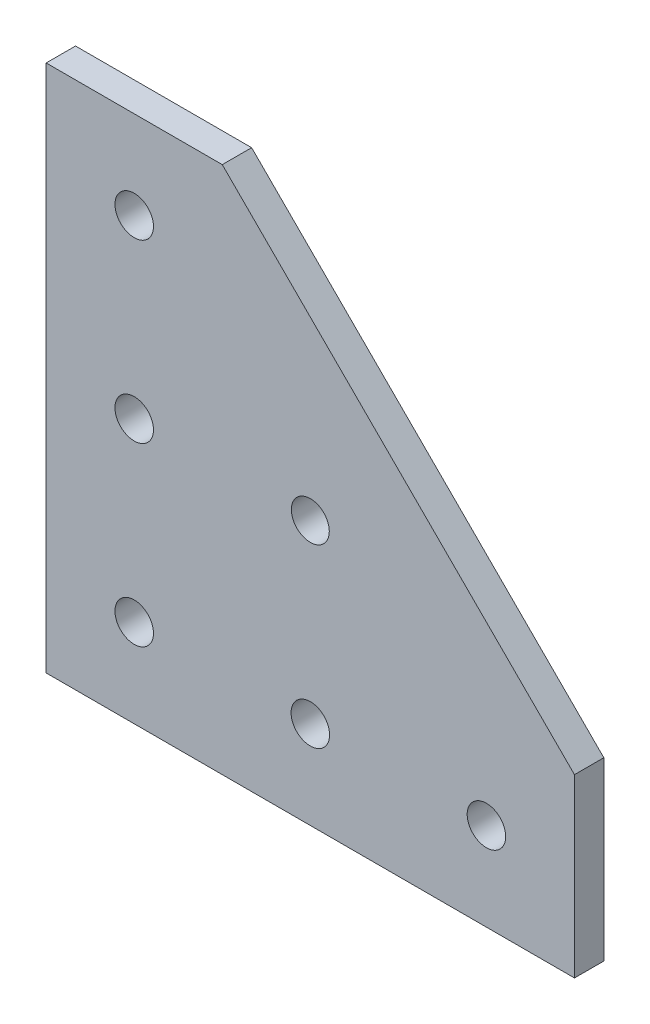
from build123d import *

# Parameters (mm, degrees)
SKETCH1_R                = 4.1656
BOSS_EXTRUDE1_DEPTH      = 3.175
F_5_16_CLEARANCE_HOLE1_D = 8.2042


with BuildPart() as part:
    # Sketch1 → Boss-Extrude1 (new, symmetric)
    with BuildSketch(Plane.XY):
        Polygon((0, 0), (0, 114.3), (38.1, 114.3), (114.3, 38.1), (114.3, 0), align=None)
        with Locations((19.05, 19.05)):
            Circle(SKETCH1_R, mode=Mode.SUBTRACT)
        with Locations((57.15, 19.05)):
            Circle(SKETCH1_R, mode=Mode.SUBTRACT)
        with Locations((95.25, 19.05)):
            Circle(SKETCH1_R, mode=Mode.SUBTRACT)
        with Locations((19.05, 57.15)):
            Circle(SKETCH1_R, mode=Mode.SUBTRACT)
        with Locations((19.05, 95.25)):
            Circle(SKETCH1_R, mode=Mode.SUBTRACT)
    extrude(amount=BOSS_EXTRUDE1_DEPTH, both=True)

    # 5_16 Clearance Hole1 (through all)
    with Locations(Plane.XY.offset(3.175)):
        with Locations((57.15, 57.15)):
            Hole(F_5_16_CLEARANCE_HOLE1_D / 2)


solid = part.part
